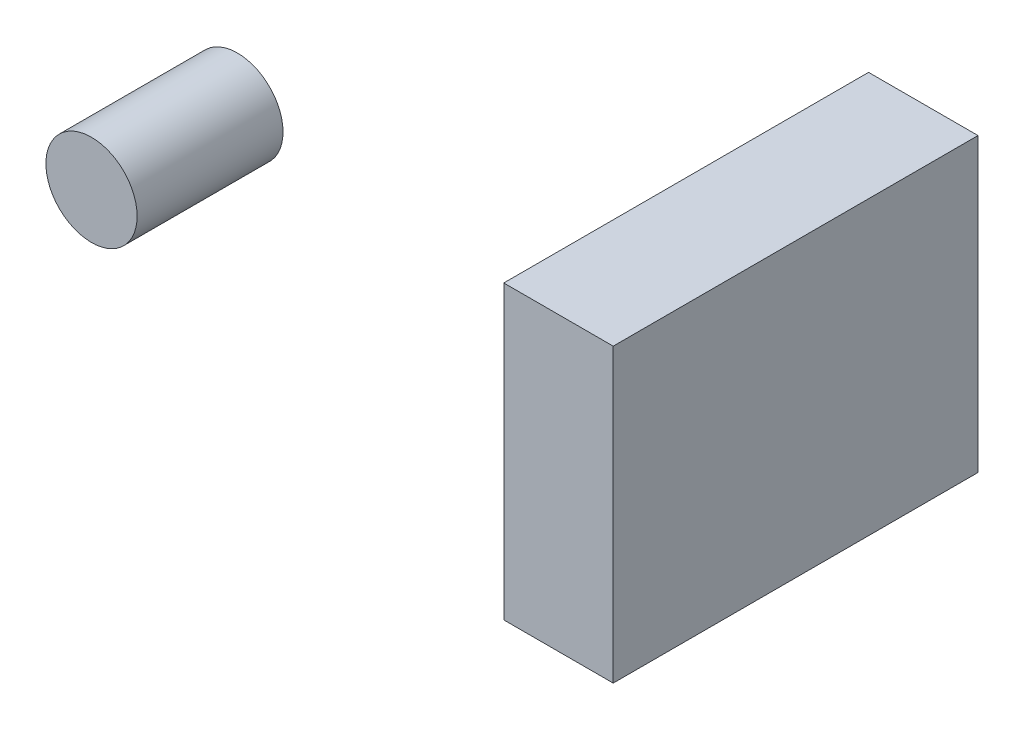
from build123d import *

# Parameters (mm, degrees)
C1_NOMINAL_12P5X20_START              = -20
SKETCH_1_R                            = 6.25
C1_NOMINAL_12P5X20_DEPTH              = 20
CN1_ASSUMED_FULLY_WIRED_KEEPOUT_START = -50
SKETCH_2_W                            = 15
SKETCH_2_H                            = 40
CN1_ASSUMED_FULLY_WIRED_KEEPOUT_DEPTH = 50


with BuildPart() as part:
    # Sketch 1 → C1_nominal_12p5x20 (new body)
    with BuildSketch(Plane.XY.offset(C1_NOMINAL_12P5X20_START)):
        with Locations((-29.024, -20.76)):
            Circle(SKETCH_1_R)
    extrude(amount=C1_NOMINAL_12P5X20_DEPTH)


with BuildPart() as body_2:
    # Sketch 2 → CN1_assumed_fully_wired_keepout (new body)
    with BuildSketch(Plane.XY.offset(CN1_ASSUMED_FULLY_WIRED_KEEPOUT_START)):
        with Locations((34.984, -23.554)):
            Rectangle(SKETCH_2_W, SKETCH_2_H)
    extrude(amount=CN1_ASSUMED_FULLY_WIRED_KEEPOUT_DEPTH)


solid = Compound([part.part, body_2.part])
